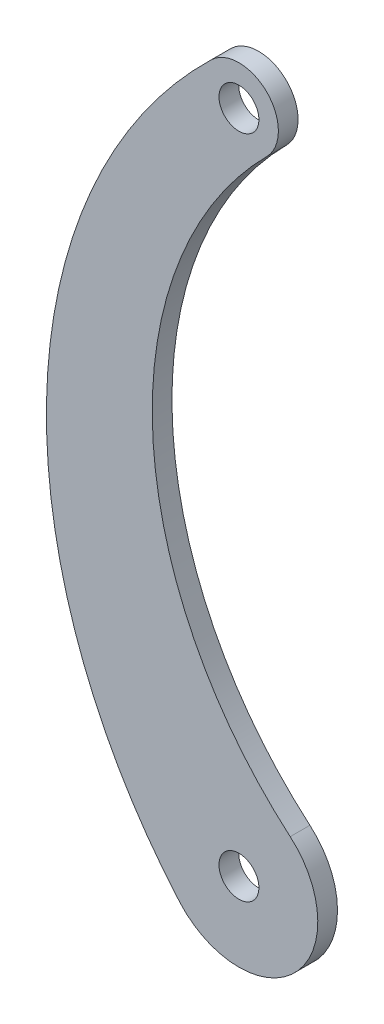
from build123d import *

# Parameters (mm, degrees)
ESQUISSE1_R        = 4.05
BOSS_EXTRU_1_DEPTH = 4


with BuildPart() as part:
    # Esquisse1 → Boss.-Extru.1 (new body)
    with BuildSketch(Plane.XY):
        with BuildLine():
            ThreePointArc((10.40035698, -122.841358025), (-17.53285686, -65.272427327), (5.672921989, -5.640740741))
            ThreePointArc((5.672921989, -5.640740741), (5.695437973, 5.618005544), (-5.562561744, 5.749600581))
            ThreePointArc((-5.562561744, 5.749600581), (-38.975608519, -68.577705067), (-12.071942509, -145.500866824))
            ThreePointArc((-12.071942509, -145.500866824), (11.36054067, -146.266681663), (10.40035698, -122.841358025))
        make_face()
        with Locations(Location((0, 0, 0), (0, 0, 180))):
            Circle(ESQUISSE1_R, mode=Mode.SUBTRACT)
        with Locations(Location((0, -135, 0), (0, 0, 180))):
            Circle(ESQUISSE1_R, mode=Mode.SUBTRACT)
    extrude(amount=-BOSS_EXTRU_1_DEPTH)


solid = part.part
